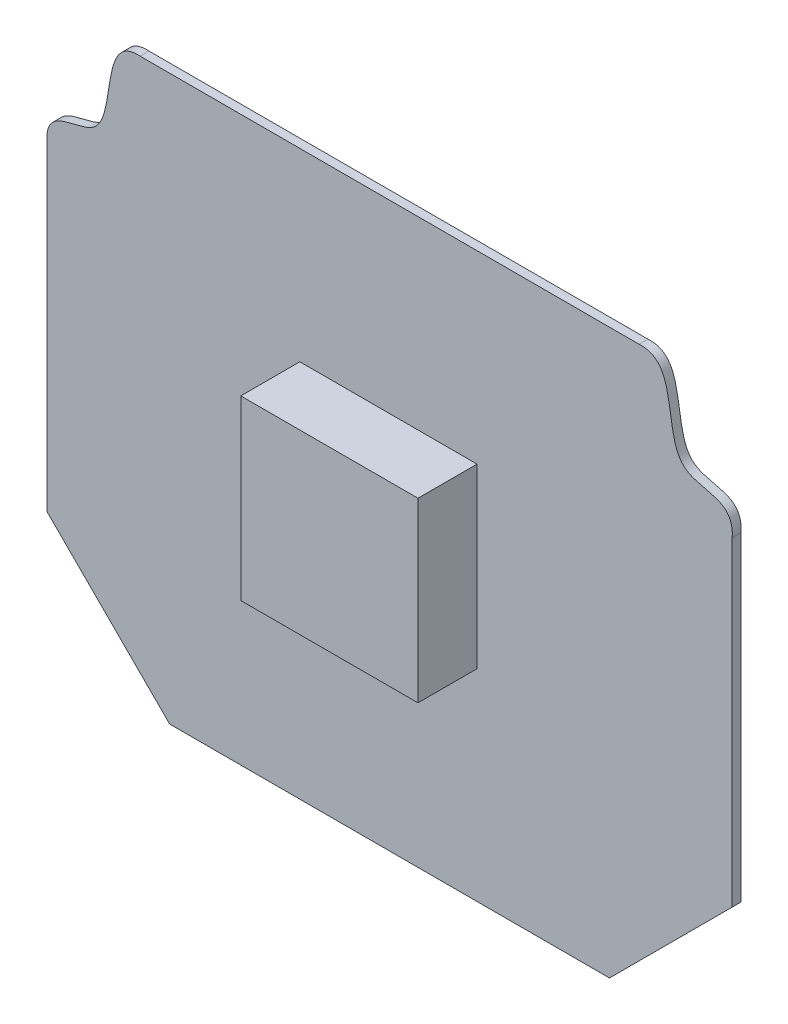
ISO-10303-21;
HEADER;
FILE_DESCRIPTION(('STEP AP214'),'2;1');
FILE_NAME('part.step','',(''),(''),'','','');
FILE_SCHEMA(('AUTOMOTIVE_DESIGN { 1 0 10303 214 1 1 1 1 }'));
ENDSEC;
DATA;
#1=APPLICATION_CONTEXT('core data for automotive mechanical design processes');
#2=APPLICATION_PROTOCOL_DEFINITION('international standard','automotive_design',2000,#1);
#3=PRODUCT_CONTEXT('',#1,'mechanical');
#4=PRODUCT('Part','Part','',(#3));
#5=PRODUCT_RELATED_PRODUCT_CATEGORY('part','',(#4));
#6=PRODUCT_DEFINITION_FORMATION('','',#4);
#7=PRODUCT_DEFINITION_CONTEXT('part definition',#1,'design');
#8=PRODUCT_DEFINITION('design','',#6,#7);
#9=PRODUCT_DEFINITION_SHAPE('','',#8);
#10=(LENGTH_UNIT() NAMED_UNIT(*) SI_UNIT(.MILLI.,.METRE.));
#11=(NAMED_UNIT(*) PLANE_ANGLE_UNIT() SI_UNIT($,.RADIAN.));
#12=(NAMED_UNIT(*) SI_UNIT($,.STERADIAN.) SOLID_ANGLE_UNIT());
#13=UNCERTAINTY_MEASURE_WITH_UNIT(LENGTH_MEASURE(1.E-05),#10,'distance_accuracy_value','');
#14=(GEOMETRIC_REPRESENTATION_CONTEXT(3) GLOBAL_UNCERTAINTY_ASSIGNED_CONTEXT((#13)) GLOBAL_UNIT_ASSIGNED_CONTEXT((#10,
#11,#12)) REPRESENTATION_CONTEXT('',''));
#15=CARTESIAN_POINT('',(0.,0.,0.));
#16=DIRECTION('',(0.,0.,1.));
#17=DIRECTION('',(1.,0.,0.));
#18=AXIS2_PLACEMENT_3D('',#15,#16,#17);
#19=CARTESIAN_POINT('',(-118.,124.044101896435,1.5));
#20=CARTESIAN_POINT('',(-118.407013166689,129.772442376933,1.5));
#21=CARTESIAN_POINT('',(-103.976782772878,125.765984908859,1.5));
#22=CARTESIAN_POINT('',(-109.23024754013,144.982690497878,1.5));
#23=CARTESIAN_POINT('',(-102.23975222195,144.542021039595,1.5));
#24=B_SPLINE_CURVE_WITH_KNOTS('',3,(#19,#20,#21,#22,#23),.UNSPECIFIED.,.F.,.F.,(4,1,4),(0.,
0.400933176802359,1.),.UNSPECIFIED.);
#25=DIRECTION('',(0.,0.,-1.));
#26=VECTOR('',#25,1.);
#27=SURFACE_OF_LINEAR_EXTRUSION('',#24,#26);
#28=CARTESIAN_POINT('',(-118.,124.044101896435,0.));
#29=CARTESIAN_POINT('',(-118.407013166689,129.772442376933,0.));
#30=CARTESIAN_POINT('',(-103.976782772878,125.765984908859,0.));
#31=CARTESIAN_POINT('',(-109.23024754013,144.982690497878,0.));
#32=CARTESIAN_POINT('',(-102.23975222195,144.542021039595,0.));
#33=B_SPLINE_CURVE_WITH_KNOTS('',3,(#28,#29,#30,#31,#32),.UNSPECIFIED.,.F.,.F.,(4,1,4),(0.,
0.400933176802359,1.),.UNSPECIFIED.);
#34=CARTESIAN_POINT('',(-118.,124.044101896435,0.));
#35=VERTEX_POINT('',#34);
#36=CARTESIAN_POINT('',(-102.23975222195,144.542021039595,0.));
#37=VERTEX_POINT('',#36);
#38=EDGE_CURVE('E200',#35,#37,#33,.T.);
#39=ORIENTED_EDGE('',*,*,#38,.F.);
#40=DIRECTION('',(0.,0.,-1.));
#41=VECTOR('',#40,1.);
#42=CARTESIAN_POINT('',(-118.,124.044101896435,1.5));
#43=LINE('',#42,#41);
#44=CARTESIAN_POINT('',(-118.,124.044101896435,1.5));
#45=VERTEX_POINT('',#44);
#46=EDGE_CURVE('E252',#45,#35,#43,.T.);
#47=ORIENTED_EDGE('',*,*,#46,.F.);
#48=CARTESIAN_POINT('',(-102.23975222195,144.542021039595,1.5));
#49=VERTEX_POINT('',#48);
#50=EDGE_CURVE('E201',#45,#49,#24,.T.);
#51=ORIENTED_EDGE('',*,*,#50,.T.);
#52=DIRECTION('',(0.,0.,-1.));
#53=VECTOR('',#52,1.);
#54=CARTESIAN_POINT('',(-102.23975222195,144.542021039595,1.5));
#55=LINE('',#54,#53);
#56=EDGE_CURVE('E254',#49,#37,#55,.T.);
#57=ORIENTED_EDGE('',*,*,#56,.T.);
#58=EDGE_LOOP('',(#39,#47,#51,#57));
#59=FACE_BOUND('',#58,.T.);
#60=ADVANCED_FACE('F33',(#59),#27,.T.);
#61=CARTESIAN_POINT('',(-118.,124.044101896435,1.5));
#62=DIRECTION('',(1.,0.,0.));
#63=DIRECTION('',(0.,0.,-1.));
#64=AXIS2_PLACEMENT_3D('',#61,#62,#63);
#65=PLANE('',#64);
#66=DIRECTION('',(0.,-1.,0.));
#67=VECTOR('',#66,1.);
#68=CARTESIAN_POINT('',(-118.,124.044101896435,0.));
#69=LINE('',#68,#67);
#70=CARTESIAN_POINT('',(-118.,69.8952521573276,0.));
#71=VERTEX_POINT('',#70);
#72=EDGE_CURVE('E208',#35,#71,#69,.T.);
#73=ORIENTED_EDGE('',*,*,#72,.T.);
#74=DIRECTION('',(0.,0.,-1.));
#75=VECTOR('',#74,1.);
#76=CARTESIAN_POINT('',(-118.,69.8952521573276,1.5));
#77=LINE('',#76,#75);
#78=CARTESIAN_POINT('',(-118.,69.8952521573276,1.5));
#79=VERTEX_POINT('',#78);
#80=EDGE_CURVE('E292',#79,#71,#77,.T.);
#81=ORIENTED_EDGE('',*,*,#80,.F.);
#82=DIRECTION('',(0.,-1.,0.));
#83=VECTOR('',#82,1.);
#84=CARTESIAN_POINT('',(-118.,124.044101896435,1.5));
#85=LINE('',#84,#83);
#86=EDGE_CURVE('E265',#45,#79,#85,.T.);
#87=ORIENTED_EDGE('',*,*,#86,.F.);
#88=ORIENTED_EDGE('',*,*,#46,.T.);
#89=EDGE_LOOP('',(#73,#81,#87,#88));
#90=FACE_BOUND('',#89,.T.);
#91=ADVANCED_FACE('F242',(#90),#65,.F.);
#92=CARTESIAN_POINT('',(-118.,69.8952521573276,1.5));
#93=DIRECTION('',(0.70710678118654,0.707106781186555,0.));
#94=DIRECTION('',(-0.707106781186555,0.70710678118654,0.));
#95=AXIS2_PLACEMENT_3D('',#92,#93,#94);
#96=PLANE('',#95);
#97=DIRECTION('',(0.707106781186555,-0.70710678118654,0.));
#98=VECTOR('',#97,1.);
#99=CARTESIAN_POINT('',(-118.,69.8952521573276,0.));
#100=LINE('',#99,#98);
#101=CARTESIAN_POINT('',(-97.2291712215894,49.1244233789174,0.));
#102=VERTEX_POINT('',#101);
#103=EDGE_CURVE('E287',#71,#102,#100,.T.);
#104=ORIENTED_EDGE('',*,*,#103,.T.);
#105=DIRECTION('',(0.,0.,-1.));
#106=VECTOR('',#105,1.);
#107=CARTESIAN_POINT('',(-97.2291712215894,49.1244233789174,1.5));
#108=LINE('',#107,#106);
#109=CARTESIAN_POINT('',(-97.2291712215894,49.1244233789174,1.5));
#110=VERTEX_POINT('',#109);
#111=EDGE_CURVE('E295',#110,#102,#108,.T.);
#112=ORIENTED_EDGE('',*,*,#111,.F.);
#113=DIRECTION('',(0.707106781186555,-0.70710678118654,0.));
#114=VECTOR('',#113,1.);
#115=CARTESIAN_POINT('',(-118.,69.8952521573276,1.5));
#116=LINE('',#115,#114);
#117=EDGE_CURVE('E378',#79,#110,#116,.T.);
#118=ORIENTED_EDGE('',*,*,#117,.F.);
#119=ORIENTED_EDGE('',*,*,#80,.T.);
#120=EDGE_LOOP('',(#104,#112,#118,#119));
#121=FACE_BOUND('',#120,.T.);
#122=ADVANCED_FACE('F247',(#121),#96,.F.);
#123=CARTESIAN_POINT('',(-97.2291712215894,49.1244233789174,1.5));
#124=DIRECTION('',(0.,1.,0.));
#125=DIRECTION('',(-1.,0.,0.));
#126=AXIS2_PLACEMENT_3D('',#123,#124,#125);
#127=PLANE('',#126);
#128=DIRECTION('',(1.,0.,0.));
#129=VECTOR('',#128,1.);
#130=CARTESIAN_POINT('',(-97.2291712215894,49.1244233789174,0.));
#131=LINE('',#130,#129);
#132=CARTESIAN_POINT('',(-22.7708287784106,49.1244233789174,0.));
#133=VERTEX_POINT('',#132);
#134=EDGE_CURVE('E284',#102,#133,#131,.T.);
#135=ORIENTED_EDGE('',*,*,#134,.T.);
#136=DIRECTION('',(0.,0.,-1.));
#137=VECTOR('',#136,1.);
#138=CARTESIAN_POINT('',(-22.7708287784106,49.1244233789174,1.5));
#139=LINE('',#138,#137);
#140=CARTESIAN_POINT('',(-22.7708287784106,49.1244233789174,1.5));
#141=VERTEX_POINT('',#140);
#142=EDGE_CURVE('E298',#141,#133,#139,.T.);
#143=ORIENTED_EDGE('',*,*,#142,.F.);
#144=DIRECTION('',(1.,0.,0.));
#145=VECTOR('',#144,1.);
#146=CARTESIAN_POINT('',(-97.2291712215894,49.1244233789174,1.5));
#147=LINE('',#146,#145);
#148=EDGE_CURVE('E375',#110,#141,#147,.T.);
#149=ORIENTED_EDGE('',*,*,#148,.F.);
#150=ORIENTED_EDGE('',*,*,#111,.T.);
#151=EDGE_LOOP('',(#135,#143,#149,#150));
#152=FACE_BOUND('',#151,.T.);
#153=ADVANCED_FACE('F372',(#152),#127,.F.);
#154=CARTESIAN_POINT('',(-2.00000000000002,69.8952521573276,1.5));
#155=DIRECTION('',(0.707106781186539,-0.707106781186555,0.));
#156=DIRECTION('',(0.707106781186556,0.707106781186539,0.));
#157=AXIS2_PLACEMENT_3D('',#154,#155,#156);
#158=PLANE('',#157);
#159=DIRECTION('',(-0.707106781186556,-0.707106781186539,0.));
#160=VECTOR('',#159,1.);
#161=CARTESIAN_POINT('',(-2.00000000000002,69.8952521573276,0.));
#162=LINE('',#161,#160);
#163=CARTESIAN_POINT('',(-2.00000000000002,69.8952521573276,0.));
#164=VERTEX_POINT('',#163);
#165=EDGE_CURVE('E281',#164,#133,#162,.T.);
#166=ORIENTED_EDGE('',*,*,#165,.F.);
#167=DIRECTION('',(0.,0.,-1.));
#168=VECTOR('',#167,1.);
#169=CARTESIAN_POINT('',(-2.00000000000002,69.8952521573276,1.5));
#170=LINE('',#169,#168);
#171=CARTESIAN_POINT('',(-2.00000000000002,69.8952521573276,1.5));
#172=VERTEX_POINT('',#171);
#173=EDGE_CURVE('E300',#172,#164,#170,.T.);
#174=ORIENTED_EDGE('',*,*,#173,.F.);
#175=DIRECTION('',(-0.707106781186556,-0.707106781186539,0.));
#176=VECTOR('',#175,1.);
#177=CARTESIAN_POINT('',(-2.00000000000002,69.8952521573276,1.5));
#178=LINE('',#177,#176);
#179=EDGE_CURVE('E379',#172,#141,#178,.T.);
#180=ORIENTED_EDGE('',*,*,#179,.T.);
#181=ORIENTED_EDGE('',*,*,#142,.T.);
#182=EDGE_LOOP('',(#166,#174,#180,#181));
#183=FACE_BOUND('',#182,.T.);
#184=ADVANCED_FACE('F367',(#183),#158,.T.);
#185=CARTESIAN_POINT('',(-1.99999999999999,124.044101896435,1.5));
#186=DIRECTION('',(1.,0.,0.));
#187=DIRECTION('',(0.,1.,0.));
#188=AXIS2_PLACEMENT_3D('',#185,#186,#187);
#189=PLANE('',#188);
#190=DIRECTION('',(0.,-1.,0.));
#191=VECTOR('',#190,1.);
#192=CARTESIAN_POINT('',(-1.99999999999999,124.044101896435,0.));
#193=LINE('',#192,#191);
#194=CARTESIAN_POINT('',(-2.00000000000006,124.044101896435,0.));
#195=VERTEX_POINT('',#194);
#196=EDGE_CURVE('E275',#195,#164,#193,.T.);
#197=ORIENTED_EDGE('',*,*,#196,.F.);
#198=DIRECTION('',(0.,0.,-1.));
#199=VECTOR('',#198,1.);
#200=CARTESIAN_POINT('',(-2.00000000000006,124.044101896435,1.5));
#201=LINE('',#200,#199);
#202=CARTESIAN_POINT('',(-2.00000000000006,124.044101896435,1.5));
#203=VERTEX_POINT('',#202);
#204=EDGE_CURVE('E302',#203,#195,#201,.T.);
#205=ORIENTED_EDGE('',*,*,#204,.F.);
#206=DIRECTION('',(0.,-1.,0.));
#207=VECTOR('',#206,1.);
#208=CARTESIAN_POINT('',(-1.99999999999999,124.044101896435,1.5));
#209=LINE('',#208,#207);
#210=EDGE_CURVE('E219',#203,#172,#209,.T.);
#211=ORIENTED_EDGE('',*,*,#210,.T.);
#212=ORIENTED_EDGE('',*,*,#173,.T.);
#213=EDGE_LOOP('',(#197,#205,#211,#212));
#214=FACE_BOUND('',#213,.T.);
#215=ADVANCED_FACE('F229',(#214),#189,.T.);
#216=CARTESIAN_POINT('',(-2.00000000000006,124.044101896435,1.5));
#217=CARTESIAN_POINT('',(-1.59298683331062,129.772442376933,1.5));
#218=CARTESIAN_POINT('',(-16.0232172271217,125.765984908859,1.5));
#219=CARTESIAN_POINT('',(-10.7697524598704,144.982690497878,1.5));
#220=CARTESIAN_POINT('',(-17.7602477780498,144.542021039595,1.5));
#221=B_SPLINE_CURVE_WITH_KNOTS('',3,(#216,#217,#218,#219,#220),.UNSPECIFIED.,.F.,.F.,(4,1,4),
(0.,0.400933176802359,1.),.UNSPECIFIED.);
#222=DIRECTION('',(0.,0.,-1.));
#223=VECTOR('',#222,1.);
#224=SURFACE_OF_LINEAR_EXTRUSION('',#221,#223);
#225=CARTESIAN_POINT('',(-2.00000000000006,124.044101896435,0.));
#226=CARTESIAN_POINT('',(-1.59298683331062,129.772442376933,0.));
#227=CARTESIAN_POINT('',(-16.0232172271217,125.765984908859,0.));
#228=CARTESIAN_POINT('',(-10.7697524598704,144.982690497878,0.));
#229=CARTESIAN_POINT('',(-17.7602477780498,144.542021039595,0.));
#230=B_SPLINE_CURVE_WITH_KNOTS('',3,(#225,#226,#227,#228,#229),.UNSPECIFIED.,.F.,.F.,(4,1,4),
(0.,0.400933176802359,1.),.UNSPECIFIED.);
#231=CARTESIAN_POINT('',(-17.7602477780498,144.542021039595,0.));
#232=VERTEX_POINT('',#231);
#233=EDGE_CURVE('E260',#195,#232,#230,.T.);
#234=ORIENTED_EDGE('',*,*,#233,.T.);
#235=DIRECTION('',(0.,0.,-1.));
#236=VECTOR('',#235,1.);
#237=CARTESIAN_POINT('',(-17.7602477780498,144.542021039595,1.5));
#238=LINE('',#237,#236);
#239=CARTESIAN_POINT('',(-17.7602477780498,144.542021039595,1.5));
#240=VERTEX_POINT('',#239);
#241=EDGE_CURVE('E304',#240,#232,#238,.T.);
#242=ORIENTED_EDGE('',*,*,#241,.F.);
#243=EDGE_CURVE('E214',#203,#240,#221,.T.);
#244=ORIENTED_EDGE('',*,*,#243,.F.);
#245=ORIENTED_EDGE('',*,*,#204,.T.);
#246=EDGE_LOOP('',(#234,#242,#244,#245));
#247=FACE_BOUND('',#246,.T.);
#248=ADVANCED_FACE('F225',(#247),#224,.F.);
#249=CARTESIAN_POINT('',(-102.23975222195,144.542021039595,1.5));
#250=DIRECTION('',(0.,1.,0.));
#251=DIRECTION('',(0.,0.,1.));
#252=AXIS2_PLACEMENT_3D('',#249,#250,#251);
#253=PLANE('',#252);
#254=DIRECTION('',(1.,0.,0.));
#255=VECTOR('',#254,1.);
#256=CARTESIAN_POINT('',(-102.23975222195,144.542021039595,0.));
#257=LINE('',#256,#255);
#258=EDGE_CURVE('E258',#37,#232,#257,.T.);
#259=ORIENTED_EDGE('',*,*,#258,.F.);
#260=ORIENTED_EDGE('',*,*,#56,.F.);
#261=DIRECTION('',(1.,0.,0.));
#262=VECTOR('',#261,1.);
#263=CARTESIAN_POINT('',(-102.23975222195,144.542021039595,1.5));
#264=LINE('',#263,#262);
#265=EDGE_CURVE('E207',#49,#240,#264,.T.);
#266=ORIENTED_EDGE('',*,*,#265,.T.);
#267=ORIENTED_EDGE('',*,*,#241,.T.);
#268=EDGE_LOOP('',(#259,#260,#266,#267));
#269=FACE_BOUND('',#268,.T.);
#270=ADVANCED_FACE('F228',(#269),#253,.T.);
#271=CARTESIAN_POINT('',(-108.558538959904,132.461364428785,1.5));
#272=DIRECTION('',(0.,0.,1.));
#273=DIRECTION('',(1.,0.,0.));
#274=AXIS2_PLACEMENT_3D('',#271,#272,#273);
#275=PLANE('',#274);
#276=DIRECTION('',(0.,1.,0.));
#277=VECTOR('',#276,1.);
#278=CARTESIAN_POINT('',(-45.1925493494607,132.461364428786,1.5));
#279=LINE('',#278,#277);
#280=CARTESIAN_POINT('',(-45.1925493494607,83.2539629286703,1.5));
#281=VERTEX_POINT('',#280);
#282=CARTESIAN_POINT('',(-45.1925493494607,113.25396292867,1.5));
#283=VERTEX_POINT('',#282);
#284=EDGE_CURVE('E48',#281,#283,#279,.T.);
#285=ORIENTED_EDGE('',*,*,#284,.F.);
#286=DIRECTION('',(1.,0.,0.));
#287=VECTOR('',#286,1.);
#288=CARTESIAN_POINT('',(-108.558538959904,83.2539629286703,1.5));
#289=LINE('',#288,#287);
#290=CARTESIAN_POINT('',(-75.1925493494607,83.2539629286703,1.5));
#291=VERTEX_POINT('',#290);
#292=EDGE_CURVE('E52',#291,#281,#289,.T.);
#293=ORIENTED_EDGE('',*,*,#292,.F.);
#294=DIRECTION('',(0.,-1.,0.));
#295=VECTOR('',#294,1.);
#296=CARTESIAN_POINT('',(-75.1925493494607,132.461364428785,1.5));
#297=LINE('',#296,#295);
#298=CARTESIAN_POINT('',(-75.1925493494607,113.25396292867,1.5));
#299=VERTEX_POINT('',#298);
#300=EDGE_CURVE('E197',#299,#291,#297,.T.);
#301=ORIENTED_EDGE('',*,*,#300,.F.);
#302=DIRECTION('',(-1.,0.,0.));
#303=VECTOR('',#302,1.);
#304=CARTESIAN_POINT('',(-108.558538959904,113.25396292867,1.5));
#305=LINE('',#304,#303);
#306=EDGE_CURVE('E187',#283,#299,#305,.T.);
#307=ORIENTED_EDGE('',*,*,#306,.F.);
#308=EDGE_LOOP('',(#285,#293,#301,#307));
#309=FACE_BOUND('',#308,.T.);
#310=ORIENTED_EDGE('',*,*,#50,.F.);
#311=ORIENTED_EDGE('',*,*,#86,.T.);
#312=ORIENTED_EDGE('',*,*,#117,.T.);
#313=ORIENTED_EDGE('',*,*,#148,.T.);
#314=ORIENTED_EDGE('',*,*,#179,.F.);
#315=ORIENTED_EDGE('',*,*,#210,.F.);
#316=ORIENTED_EDGE('',*,*,#243,.T.);
#317=ORIENTED_EDGE('',*,*,#265,.F.);
#318=EDGE_LOOP('',(#310,#311,#312,#313,#314,#315,#316,#317));
#319=FACE_BOUND('',#318,.T.);
#320=ADVANCED_FACE('F233',(#309,#319),#275,.T.);
#321=CARTESIAN_POINT('',(-108.558538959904,132.461364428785,0.));
#322=DIRECTION('',(0.,0.,1.));
#323=DIRECTION('',(1.,0.,0.));
#324=AXIS2_PLACEMENT_3D('',#321,#322,#323);
#325=PLANE('',#324);
#326=DIRECTION('',(1.,0.,0.));
#327=VECTOR('',#326,1.);
#328=CARTESIAN_POINT('',(-108.558538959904,83.2539629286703,0.));
#329=LINE('',#328,#327);
#330=CARTESIAN_POINT('',(-75.1925493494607,83.2539629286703,0.));
#331=VERTEX_POINT('',#330);
#332=CARTESIAN_POINT('',(-45.1925493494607,83.2539629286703,0.));
#333=VERTEX_POINT('',#332);
#334=EDGE_CURVE('E41',#331,#333,#329,.T.);
#335=ORIENTED_EDGE('',*,*,#334,.T.);
#336=DIRECTION('',(0.,1.,0.));
#337=VECTOR('',#336,1.);
#338=CARTESIAN_POINT('',(-45.1925493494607,132.461364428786,0.));
#339=LINE('',#338,#337);
#340=CARTESIAN_POINT('',(-45.1925493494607,113.25396292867,0.));
#341=VERTEX_POINT('',#340);
#342=EDGE_CURVE('E11',#333,#341,#339,.T.);
#343=ORIENTED_EDGE('',*,*,#342,.T.);
#344=DIRECTION('',(-1.,0.,0.));
#345=VECTOR('',#344,1.);
#346=CARTESIAN_POINT('',(-108.558538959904,113.25396292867,0.));
#347=LINE('',#346,#345);
#348=CARTESIAN_POINT('',(-75.1925493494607,113.25396292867,0.));
#349=VERTEX_POINT('',#348);
#350=EDGE_CURVE('E291',#341,#349,#347,.T.);
#351=ORIENTED_EDGE('',*,*,#350,.T.);
#352=DIRECTION('',(0.,-1.,0.));
#353=VECTOR('',#352,1.);
#354=CARTESIAN_POINT('',(-75.1925493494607,132.461364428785,0.));
#355=LINE('',#354,#353);
#356=EDGE_CURVE('E309',#349,#331,#355,.T.);
#357=ORIENTED_EDGE('',*,*,#356,.T.);
#358=EDGE_LOOP('',(#335,#343,#351,#357));
#359=FACE_BOUND('',#358,.T.);
#360=ORIENTED_EDGE('',*,*,#38,.T.);
#361=ORIENTED_EDGE('',*,*,#258,.T.);
#362=ORIENTED_EDGE('',*,*,#233,.F.);
#363=ORIENTED_EDGE('',*,*,#196,.T.);
#364=ORIENTED_EDGE('',*,*,#165,.T.);
#365=ORIENTED_EDGE('',*,*,#134,.F.);
#366=ORIENTED_EDGE('',*,*,#103,.F.);
#367=ORIENTED_EDGE('',*,*,#72,.F.);
#368=EDGE_LOOP('',(#360,#361,#362,#363,#364,#365,#366,#367));
#369=FACE_BOUND('',#368,.T.);
#370=ADVANCED_FACE('F238',(#359,#369),#325,.F.);
#371=CARTESIAN_POINT('',(0.,0.,-10.));
#372=DIRECTION('',(0.,0.,1.));
#373=DIRECTION('',(1.,0.,0.));
#374=AXIS2_PLACEMENT_3D('',#371,#372,#373);
#375=PLANE('',#374);
#376=DIRECTION('',(0.,1.,0.));
#377=VECTOR('',#376,1.);
#378=CARTESIAN_POINT('',(-45.1925493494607,113.25396292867,-10.));
#379=LINE('',#378,#377);
#380=CARTESIAN_POINT('',(-45.1925493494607,83.2539629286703,-10.));
#381=VERTEX_POINT('',#380);
#382=CARTESIAN_POINT('',(-45.1925493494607,113.25396292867,-10.));
#383=VERTEX_POINT('',#382);
#384=EDGE_CURVE('E173',#381,#383,#379,.T.);
#385=ORIENTED_EDGE('',*,*,#384,.F.);
#386=DIRECTION('',(1.,0.,0.));
#387=VECTOR('',#386,1.);
#388=CARTESIAN_POINT('',(-75.1925493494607,83.2539629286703,-10.));
#389=LINE('',#388,#387);
#390=CARTESIAN_POINT('',(-75.1925493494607,83.2539629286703,-10.));
#391=VERTEX_POINT('',#390);
#392=EDGE_CURVE('E153',#391,#381,#389,.T.);
#393=ORIENTED_EDGE('',*,*,#392,.F.);
#394=DIRECTION('',(0.,-1.,0.));
#395=VECTOR('',#394,1.);
#396=CARTESIAN_POINT('',(-75.1925493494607,113.25396292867,-10.));
#397=LINE('',#396,#395);
#398=CARTESIAN_POINT('',(-75.1925493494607,113.25396292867,-10.));
#399=VERTEX_POINT('',#398);
#400=EDGE_CURVE('E179',#399,#391,#397,.T.);
#401=ORIENTED_EDGE('',*,*,#400,.F.);
#402=DIRECTION('',(-1.,0.,0.));
#403=VECTOR('',#402,1.);
#404=CARTESIAN_POINT('',(-75.1925493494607,113.25396292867,-10.));
#405=LINE('',#404,#403);
#406=EDGE_CURVE('E176',#383,#399,#405,.T.);
#407=ORIENTED_EDGE('',*,*,#406,.F.);
#408=EDGE_LOOP('',(#385,#393,#401,#407));
#409=FACE_BOUND('',#408,.T.);
#410=ADVANCED_FACE('F323',(#409),#375,.F.);
#411=CARTESIAN_POINT('',(-75.1925493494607,113.25396292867,-10.));
#412=DIRECTION('',(0.,1.,0.));
#413=DIRECTION('',(0.,0.,1.));
#414=AXIS2_PLACEMENT_3D('',#411,#412,#413);
#415=PLANE('',#414);
#416=ORIENTED_EDGE('',*,*,#350,.F.);
#417=DIRECTION('',(0.,0.,1.));
#418=VECTOR('',#417,1.);
#419=CARTESIAN_POINT('',(-45.1925493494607,113.25396292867,-10.));
#420=LINE('',#419,#418);
#421=EDGE_CURVE('E152',#383,#341,#420,.T.);
#422=ORIENTED_EDGE('',*,*,#421,.F.);
#423=ORIENTED_EDGE('',*,*,#406,.T.);
#424=DIRECTION('',(0.,0.,1.));
#425=VECTOR('',#424,1.);
#426=CARTESIAN_POINT('',(-75.1925493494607,113.25396292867,-10.));
#427=LINE('',#426,#425);
#428=EDGE_CURVE('E193',#399,#349,#427,.T.);
#429=ORIENTED_EDGE('',*,*,#428,.T.);
#430=EDGE_LOOP('',(#416,#422,#423,#429));
#431=FACE_BOUND('',#430,.T.);
#432=ADVANCED_FACE('F327',(#431),#415,.T.);
#433=CARTESIAN_POINT('',(-75.1925493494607,113.25396292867,-10.));
#434=DIRECTION('',(-1.,0.,0.));
#435=DIRECTION('',(0.,-1.,0.));
#436=AXIS2_PLACEMENT_3D('',#433,#434,#435);
#437=PLANE('',#436);
#438=ORIENTED_EDGE('',*,*,#356,.F.);
#439=ORIENTED_EDGE('',*,*,#428,.F.);
#440=ORIENTED_EDGE('',*,*,#400,.T.);
#441=DIRECTION('',(0.,0.,1.));
#442=VECTOR('',#441,1.);
#443=CARTESIAN_POINT('',(-75.1925493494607,83.2539629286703,-10.));
#444=LINE('',#443,#442);
#445=EDGE_CURVE('E189',#391,#331,#444,.T.);
#446=ORIENTED_EDGE('',*,*,#445,.T.);
#447=EDGE_LOOP('',(#438,#439,#440,#446));
#448=FACE_BOUND('',#447,.T.);
#449=ADVANCED_FACE('F317',(#448),#437,.T.);
#450=CARTESIAN_POINT('',(-75.1925493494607,83.2539629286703,-10.));
#451=DIRECTION('',(0.,-1.,0.));
#452=DIRECTION('',(0.,0.,-1.));
#453=AXIS2_PLACEMENT_3D('',#450,#451,#452);
#454=PLANE('',#453);
#455=ORIENTED_EDGE('',*,*,#334,.F.);
#456=ORIENTED_EDGE('',*,*,#445,.F.);
#457=ORIENTED_EDGE('',*,*,#392,.T.);
#458=DIRECTION('',(0.,0.,1.));
#459=VECTOR('',#458,1.);
#460=CARTESIAN_POINT('',(-45.1925493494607,83.2539629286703,-10.));
#461=LINE('',#460,#459);
#462=EDGE_CURVE('E184',#381,#333,#461,.T.);
#463=ORIENTED_EDGE('',*,*,#462,.T.);
#464=EDGE_LOOP('',(#455,#456,#457,#463));
#465=FACE_BOUND('',#464,.T.);
#466=ADVANCED_FACE('F315',(#465),#454,.T.);
#467=CARTESIAN_POINT('',(-45.1925493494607,113.25396292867,-10.));
#468=DIRECTION('',(1.,0.,0.));
#469=DIRECTION('',(0.,1.,0.));
#470=AXIS2_PLACEMENT_3D('',#467,#468,#469);
#471=PLANE('',#470);
#472=ORIENTED_EDGE('',*,*,#342,.F.);
#473=ORIENTED_EDGE('',*,*,#462,.F.);
#474=ORIENTED_EDGE('',*,*,#384,.T.);
#475=ORIENTED_EDGE('',*,*,#421,.T.);
#476=EDGE_LOOP('',(#472,#473,#474,#475));
#477=FACE_BOUND('',#476,.T.);
#478=ADVANCED_FACE('F325',(#477),#471,.T.);
#479=CARTESIAN_POINT('',(-45.1925493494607,83.2539629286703,11.5));
#480=VERTEX_POINT('',#479);
#481=EDGE_CURVE('E188',#281,#480,#461,.T.);
#482=ORIENTED_EDGE('',*,*,#481,.F.);
#483=ORIENTED_EDGE('',*,*,#284,.T.);
#484=CARTESIAN_POINT('',(-45.1925493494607,113.25396292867,11.5));
#485=VERTEX_POINT('',#484);
#486=EDGE_CURVE('E144',#283,#485,#420,.T.);
#487=ORIENTED_EDGE('',*,*,#486,.T.);
#488=DIRECTION('',(0.,1.,0.));
#489=VECTOR('',#488,1.);
#490=CARTESIAN_POINT('',(-45.1925493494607,113.25396292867,11.5));
#491=LINE('',#490,#489);
#492=EDGE_CURVE('E149',#480,#485,#491,.T.);
#493=ORIENTED_EDGE('',*,*,#492,.F.);
#494=EDGE_LOOP('',(#482,#483,#487,#493));
#495=FACE_BOUND('',#494,.T.);
#496=ADVANCED_FACE('F147',(#495),#471,.T.);
#497=CARTESIAN_POINT('',(-75.1925493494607,83.2539629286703,11.5));
#498=VERTEX_POINT('',#497);
#499=EDGE_CURVE('E192',#291,#498,#444,.T.);
#500=ORIENTED_EDGE('',*,*,#499,.F.);
#501=ORIENTED_EDGE('',*,*,#292,.T.);
#502=ORIENTED_EDGE('',*,*,#481,.T.);
#503=DIRECTION('',(1.,0.,0.));
#504=VECTOR('',#503,1.);
#505=CARTESIAN_POINT('',(-75.1925493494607,83.2539629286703,11.5));
#506=LINE('',#505,#504);
#507=EDGE_CURVE('E168',#498,#480,#506,.T.);
#508=ORIENTED_EDGE('',*,*,#507,.F.);
#509=EDGE_LOOP('',(#500,#501,#502,#508));
#510=FACE_BOUND('',#509,.T.);
#511=ADVANCED_FACE('F344',(#510),#454,.T.);
#512=CARTESIAN_POINT('',(-75.1925493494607,113.25396292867,11.5));
#513=VERTEX_POINT('',#512);
#514=EDGE_CURVE('E159',#299,#513,#427,.T.);
#515=ORIENTED_EDGE('',*,*,#514,.F.);
#516=ORIENTED_EDGE('',*,*,#300,.T.);
#517=ORIENTED_EDGE('',*,*,#499,.T.);
#518=DIRECTION('',(0.,-1.,0.));
#519=VECTOR('',#518,1.);
#520=CARTESIAN_POINT('',(-75.1925493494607,113.25396292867,11.5));
#521=LINE('',#520,#519);
#522=EDGE_CURVE('E163',#513,#498,#521,.T.);
#523=ORIENTED_EDGE('',*,*,#522,.F.);
#524=EDGE_LOOP('',(#515,#516,#517,#523));
#525=FACE_BOUND('',#524,.T.);
#526=ADVANCED_FACE('F335',(#525),#437,.T.);
#527=ORIENTED_EDGE('',*,*,#486,.F.);
#528=ORIENTED_EDGE('',*,*,#306,.T.);
#529=ORIENTED_EDGE('',*,*,#514,.T.);
#530=DIRECTION('',(-1.,0.,0.));
#531=VECTOR('',#530,1.);
#532=CARTESIAN_POINT('',(-75.1925493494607,113.25396292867,11.5));
#533=LINE('',#532,#531);
#534=EDGE_CURVE('E156',#485,#513,#533,.T.);
#535=ORIENTED_EDGE('',*,*,#534,.F.);
#536=EDGE_LOOP('',(#527,#528,#529,#535));
#537=FACE_BOUND('',#536,.T.);
#538=ADVANCED_FACE('F157',(#537),#415,.T.);
#539=CARTESIAN_POINT('',(0.,0.,11.5));
#540=DIRECTION('',(0.,0.,1.));
#541=DIRECTION('',(1.,0.,0.));
#542=AXIS2_PLACEMENT_3D('',#539,#540,#541);
#543=PLANE('',#542);
#544=ORIENTED_EDGE('',*,*,#492,.T.);
#545=ORIENTED_EDGE('',*,*,#534,.T.);
#546=ORIENTED_EDGE('',*,*,#522,.T.);
#547=ORIENTED_EDGE('',*,*,#507,.T.);
#548=EDGE_LOOP('',(#544,#545,#546,#547));
#549=FACE_BOUND('',#548,.T.);
#550=ADVANCED_FACE('F166',(#549),#543,.T.);
#551=CLOSED_SHELL('',(#60,#91,#122,#153,#184,#215,#248,#270,#320,#370,#410,#432,#449,#466,#478,
#496,#511,#526,#538,#550));
#552=MANIFOLD_SOLID_BREP('B2',#551);
#553=ADVANCED_BREP_SHAPE_REPRESENTATION('',(#18,#552),#14);
#554=SHAPE_DEFINITION_REPRESENTATION(#9,#553);
ENDSEC;
END-ISO-10303-21;
